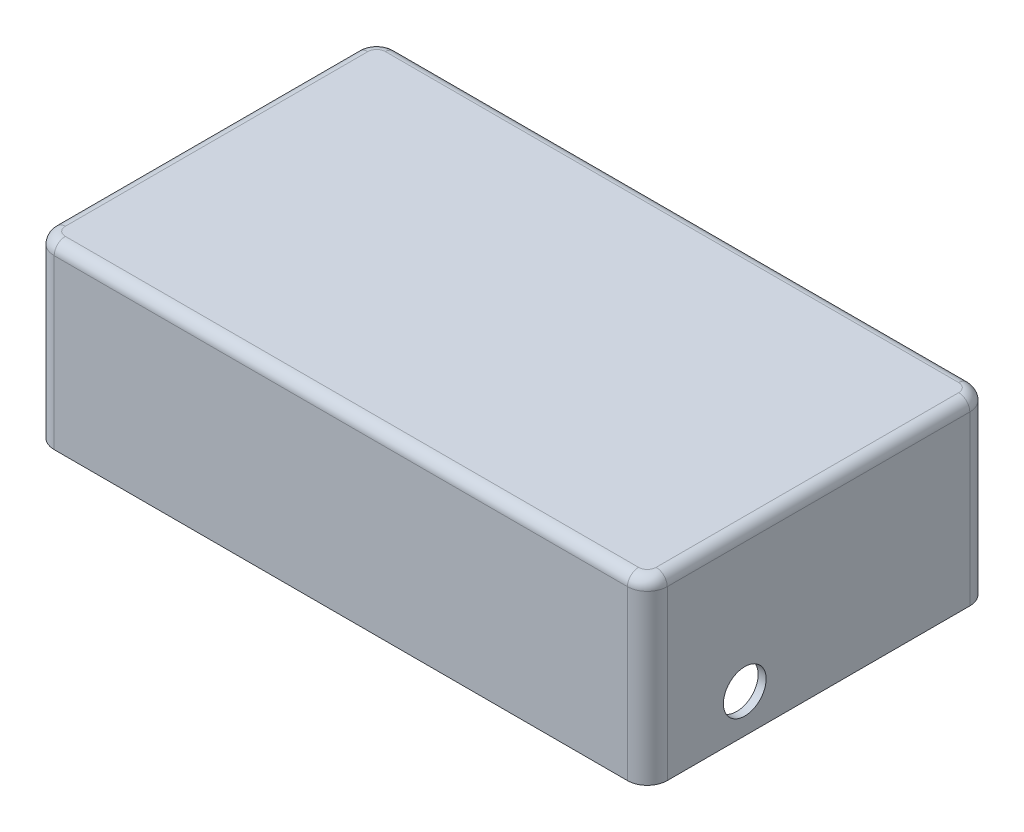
ISO-10303-21;
HEADER;
FILE_DESCRIPTION(('STEP AP214'),'2;1');
FILE_NAME('part.step','',(''),(''),'','','');
FILE_SCHEMA(('AUTOMOTIVE_DESIGN { 1 0 10303 214 1 1 1 1 }'));
ENDSEC;
DATA;
#1=APPLICATION_CONTEXT('core data for automotive mechanical design processes');
#2=APPLICATION_PROTOCOL_DEFINITION('international standard','automotive_design',2000,#1);
#3=PRODUCT_CONTEXT('',#1,'mechanical');
#4=PRODUCT('Part','Part','',(#3));
#5=PRODUCT_RELATED_PRODUCT_CATEGORY('part','',(#4));
#6=PRODUCT_DEFINITION_FORMATION('','',#4);
#7=PRODUCT_DEFINITION_CONTEXT('part definition',#1,'design');
#8=PRODUCT_DEFINITION('design','',#6,#7);
#9=PRODUCT_DEFINITION_SHAPE('','',#8);
#10=(LENGTH_UNIT() NAMED_UNIT(*) SI_UNIT(.MILLI.,.METRE.));
#11=(NAMED_UNIT(*) PLANE_ANGLE_UNIT() SI_UNIT($,.RADIAN.));
#12=(NAMED_UNIT(*) SI_UNIT($,.STERADIAN.) SOLID_ANGLE_UNIT());
#13=UNCERTAINTY_MEASURE_WITH_UNIT(LENGTH_MEASURE(1.E-05),#10,'distance_accuracy_value','');
#14=(GEOMETRIC_REPRESENTATION_CONTEXT(3) GLOBAL_UNCERTAINTY_ASSIGNED_CONTEXT((#13)) GLOBAL_UNIT_ASSIGNED_CONTEXT((#10,
#11,#12)) REPRESENTATION_CONTEXT('',''));
#15=CARTESIAN_POINT('',(0.,0.,0.));
#16=DIRECTION('',(0.,0.,1.));
#17=DIRECTION('',(1.,0.,0.));
#18=AXIS2_PLACEMENT_3D('',#15,#16,#17);
#19=CARTESIAN_POINT('',(0.,57.15,0.));
#20=DIRECTION('',(0.,1.,0.));
#21=DIRECTION('',(0.,0.,1.));
#22=AXIS2_PLACEMENT_3D('',#19,#20,#21);
#23=PLANE('',#22);
#24=CARTESIAN_POINT('',(91.44,57.15,48.26));
#25=DIRECTION('',(0.,1.,0.));
#26=DIRECTION('',(0.,0.,1.));
#27=AXIS2_PLACEMENT_3D('',#24,#25,#26);
#28=CIRCLE('',#27,2.794);
#29=CARTESIAN_POINT('',(94.234,57.15,48.26));
#30=VERTEX_POINT('',#29);
#31=CARTESIAN_POINT('',(91.44,57.15,51.054));
#32=VERTEX_POINT('',#31);
#33=EDGE_CURVE('E336',#30,#32,#28,.F.);
#34=ORIENTED_EDGE('',*,*,#33,.F.);
#35=DIRECTION('',(0.,0.,-1.));
#36=VECTOR('',#35,1.);
#37=CARTESIAN_POINT('',(94.234,57.15,-54.61));
#38=LINE('',#37,#36);
#39=CARTESIAN_POINT('',(94.234,57.15,-48.26));
#40=VERTEX_POINT('',#39);
#41=EDGE_CURVE('E299',#30,#40,#38,.T.);
#42=ORIENTED_EDGE('',*,*,#41,.T.);
#43=CARTESIAN_POINT('',(91.44,57.15,-48.26));
#44=DIRECTION('',(0.,1.,0.));
#45=DIRECTION('',(0.,0.,1.));
#46=AXIS2_PLACEMENT_3D('',#43,#44,#45);
#47=CIRCLE('',#46,2.794);
#48=CARTESIAN_POINT('',(91.44,57.15,-51.054));
#49=VERTEX_POINT('',#48);
#50=EDGE_CURVE('E334',#49,#40,#47,.F.);
#51=ORIENTED_EDGE('',*,*,#50,.F.);
#52=DIRECTION('',(-1.,0.,0.));
#53=VECTOR('',#52,1.);
#54=CARTESIAN_POINT('',(-97.79,57.15,-51.054));
#55=LINE('',#54,#53);
#56=CARTESIAN_POINT('',(-91.44,57.15,-51.054));
#57=VERTEX_POINT('',#56);
#58=EDGE_CURVE('E308',#49,#57,#55,.T.);
#59=ORIENTED_EDGE('',*,*,#58,.T.);
#60=CARTESIAN_POINT('',(-91.44,57.15,-48.26));
#61=DIRECTION('',(0.,1.,0.));
#62=DIRECTION('',(0.,0.,1.));
#63=AXIS2_PLACEMENT_3D('',#60,#61,#62);
#64=CIRCLE('',#63,2.794);
#65=CARTESIAN_POINT('',(-94.234,57.15,-48.26));
#66=VERTEX_POINT('',#65);
#67=EDGE_CURVE('E331',#66,#57,#64,.F.);
#68=ORIENTED_EDGE('',*,*,#67,.F.);
#69=DIRECTION('',(0.,0.,1.));
#70=VECTOR('',#69,1.);
#71=CARTESIAN_POINT('',(-94.234,57.15,54.61));
#72=LINE('',#71,#70);
#73=CARTESIAN_POINT('',(-94.234,57.15,48.26));
#74=VERTEX_POINT('',#73);
#75=EDGE_CURVE('E305',#66,#74,#72,.T.);
#76=ORIENTED_EDGE('',*,*,#75,.T.);
#77=CARTESIAN_POINT('',(-91.44,57.15,48.26));
#78=DIRECTION('',(0.,1.,0.));
#79=DIRECTION('',(0.,0.,1.));
#80=AXIS2_PLACEMENT_3D('',#77,#78,#79);
#81=CIRCLE('',#80,2.794);
#82=CARTESIAN_POINT('',(-91.44,57.15,51.054));
#83=VERTEX_POINT('',#82);
#84=EDGE_CURVE('E328',#83,#74,#81,.F.);
#85=ORIENTED_EDGE('',*,*,#84,.F.);
#86=DIRECTION('',(1.,0.,0.));
#87=VECTOR('',#86,1.);
#88=CARTESIAN_POINT('',(97.79,57.15,51.054));
#89=LINE('',#88,#87);
#90=EDGE_CURVE('E302',#83,#32,#89,.T.);
#91=ORIENTED_EDGE('',*,*,#90,.T.);
#92=EDGE_LOOP('',(#34,#42,#51,#59,#68,#76,#85,#91));
#93=FACE_BOUND('',#92,.T.);
#94=ADVANCED_FACE('F35',(#93),#23,.T.);
#95=CARTESIAN_POINT('',(-97.79,57.15,-54.61));
#96=DIRECTION('',(1.,0.,0.));
#97=DIRECTION('',(0.,0.,-1.));
#98=AXIS2_PLACEMENT_3D('',#95,#96,#97);
#99=PLANE('',#98);
#100=DIRECTION('',(0.,0.,1.));
#101=VECTOR('',#100,1.);
#102=CARTESIAN_POINT('',(-97.79,0.,-54.61));
#103=LINE('',#102,#101);
#104=CARTESIAN_POINT('',(-97.79,0.,-48.26));
#105=VERTEX_POINT('',#104);
#106=CARTESIAN_POINT('',(-97.79,0.,48.26));
#107=VERTEX_POINT('',#106);
#108=EDGE_CURVE('E287',#105,#107,#103,.T.);
#109=ORIENTED_EDGE('',*,*,#108,.T.);
#110=DIRECTION('',(0.,-1.,0.));
#111=VECTOR('',#110,1.);
#112=CARTESIAN_POINT('',(-97.79,57.15,48.26));
#113=LINE('',#112,#111);
#114=CARTESIAN_POINT('',(-97.79,53.594,48.26));
#115=VERTEX_POINT('',#114);
#116=EDGE_CURVE('E364',#107,#115,#113,.F.);
#117=ORIENTED_EDGE('',*,*,#116,.T.);
#118=DIRECTION('',(0.,0.,1.));
#119=VECTOR('',#118,1.);
#120=CARTESIAN_POINT('',(-97.79,53.594,-54.61));
#121=LINE('',#120,#119);
#122=CARTESIAN_POINT('',(-97.79,53.594,-48.26));
#123=VERTEX_POINT('',#122);
#124=EDGE_CURVE('E314',#115,#123,#121,.F.);
#125=ORIENTED_EDGE('',*,*,#124,.T.);
#126=DIRECTION('',(0.,-1.,0.));
#127=VECTOR('',#126,1.);
#128=CARTESIAN_POINT('',(-97.79,57.15,-48.26));
#129=LINE('',#128,#127);
#130=EDGE_CURVE('E362',#123,#105,#129,.T.);
#131=ORIENTED_EDGE('',*,*,#130,.T.);
#132=EDGE_LOOP('',(#109,#117,#125,#131));
#133=FACE_BOUND('',#132,.T.);
#134=ADVANCED_FACE('F488',(#133),#99,.F.);
#135=CARTESIAN_POINT('',(-97.79,57.15,54.61));
#136=DIRECTION('',(0.,0.,-1.));
#137=DIRECTION('',(-1.,0.,0.));
#138=AXIS2_PLACEMENT_3D('',#135,#136,#137);
#139=PLANE('',#138);
#140=DIRECTION('',(1.,0.,0.));
#141=VECTOR('',#140,1.);
#142=CARTESIAN_POINT('',(-97.79,53.594,54.61));
#143=LINE('',#142,#141);
#144=CARTESIAN_POINT('',(91.44,53.594,54.61));
#145=VERTEX_POINT('',#144);
#146=CARTESIAN_POINT('',(-91.44,53.594,54.61));
#147=VERTEX_POINT('',#146);
#148=EDGE_CURVE('E317',#145,#147,#143,.F.);
#149=ORIENTED_EDGE('',*,*,#148,.T.);
#150=DIRECTION('',(0.,-1.,0.));
#151=VECTOR('',#150,1.);
#152=CARTESIAN_POINT('',(-91.44,57.15,54.61));
#153=LINE('',#152,#151);
#154=CARTESIAN_POINT('',(-91.44,0.,54.61));
#155=VERTEX_POINT('',#154);
#156=EDGE_CURVE('E353',#147,#155,#153,.T.);
#157=ORIENTED_EDGE('',*,*,#156,.T.);
#158=DIRECTION('',(1.,0.,0.));
#159=VECTOR('',#158,1.);
#160=CARTESIAN_POINT('',(-97.79,0.,54.61));
#161=LINE('',#160,#159);
#162=CARTESIAN_POINT('',(91.44,0.,54.61));
#163=VERTEX_POINT('',#162);
#164=EDGE_CURVE('E290',#155,#163,#161,.T.);
#165=ORIENTED_EDGE('',*,*,#164,.T.);
#166=DIRECTION('',(0.,-1.,0.));
#167=VECTOR('',#166,1.);
#168=CARTESIAN_POINT('',(91.44,57.15,54.61));
#169=LINE('',#168,#167);
#170=EDGE_CURVE('E351',#163,#145,#169,.F.);
#171=ORIENTED_EDGE('',*,*,#170,.T.);
#172=EDGE_LOOP('',(#149,#157,#165,#171));
#173=FACE_BOUND('',#172,.T.);
#174=ADVANCED_FACE('F446',(#173),#139,.F.);
#175=CARTESIAN_POINT('',(97.79,57.15,-54.61));
#176=DIRECTION('',(-1.,0.,0.));
#177=DIRECTION('',(0.,0.,1.));
#178=AXIS2_PLACEMENT_3D('',#175,#176,#177);
#179=PLANE('',#178);
#180=CARTESIAN_POINT('',(97.79,12.3054100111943,23.5333339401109));
#181=DIRECTION('',(1.,0.,0.));
#182=DIRECTION('',(0.,0.,-1.));
#183=AXIS2_PLACEMENT_3D('',#180,#181,#182);
#184=CIRCLE('',#183,6.82354044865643);
#185=CARTESIAN_POINT('',(97.79,12.3054100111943,16.7097934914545));
#186=VERTEX_POINT('',#185);
#187=EDGE_CURVE('E427',#186,#186,#184,.T.);
#188=ORIENTED_EDGE('',*,*,#187,.F.);
#189=EDGE_LOOP('',(#188));
#190=FACE_BOUND('',#189,.T.);
#191=DIRECTION('',(0.,0.,-1.));
#192=VECTOR('',#191,1.);
#193=CARTESIAN_POINT('',(97.79,0.,-54.61));
#194=LINE('',#193,#192);
#195=CARTESIAN_POINT('',(97.79,0.,48.26));
#196=VERTEX_POINT('',#195);
#197=CARTESIAN_POINT('',(97.79,0.,-48.26));
#198=VERTEX_POINT('',#197);
#199=EDGE_CURVE('E294',#196,#198,#194,.T.);
#200=ORIENTED_EDGE('',*,*,#199,.T.);
#201=DIRECTION('',(0.,-1.,0.));
#202=VECTOR('',#201,1.);
#203=CARTESIAN_POINT('',(97.79,57.15,-48.26));
#204=LINE('',#203,#202);
#205=CARTESIAN_POINT('',(97.79,53.594,-48.26));
#206=VERTEX_POINT('',#205);
#207=EDGE_CURVE('E11',#198,#206,#204,.F.);
#208=ORIENTED_EDGE('',*,*,#207,.T.);
#209=DIRECTION('',(0.,0.,-1.));
#210=VECTOR('',#209,1.);
#211=CARTESIAN_POINT('',(97.79,53.594,54.61));
#212=LINE('',#211,#210);
#213=CARTESIAN_POINT('',(97.79,53.594,48.26));
#214=VERTEX_POINT('',#213);
#215=EDGE_CURVE('E320',#206,#214,#212,.F.);
#216=ORIENTED_EDGE('',*,*,#215,.T.);
#217=DIRECTION('',(0.,-1.,0.));
#218=VECTOR('',#217,1.);
#219=CARTESIAN_POINT('',(97.79,57.15,48.26));
#220=LINE('',#219,#218);
#221=EDGE_CURVE('E44',#214,#196,#220,.T.);
#222=ORIENTED_EDGE('',*,*,#221,.T.);
#223=EDGE_LOOP('',(#200,#208,#216,#222));
#224=FACE_BOUND('',#223,.T.);
#225=ADVANCED_FACE('F442',(#190,#224),#179,.F.);
#226=CARTESIAN_POINT('',(-97.79,57.15,-54.61));
#227=DIRECTION('',(0.,0.,1.));
#228=DIRECTION('',(1.,0.,0.));
#229=AXIS2_PLACEMENT_3D('',#226,#227,#228);
#230=PLANE('',#229);
#231=DIRECTION('',(-1.,0.,0.));
#232=VECTOR('',#231,1.);
#233=CARTESIAN_POINT('',(-97.79,0.,-54.61));
#234=LINE('',#233,#232);
#235=CARTESIAN_POINT('',(91.44,0.,-54.61));
#236=VERTEX_POINT('',#235);
#237=CARTESIAN_POINT('',(-91.44,0.,-54.61));
#238=VERTEX_POINT('',#237);
#239=EDGE_CURVE('E296',#236,#238,#234,.T.);
#240=ORIENTED_EDGE('',*,*,#239,.T.);
#241=DIRECTION('',(0.,-1.,0.));
#242=VECTOR('',#241,1.);
#243=CARTESIAN_POINT('',(-91.44,57.15,-54.61));
#244=LINE('',#243,#242);
#245=CARTESIAN_POINT('',(-91.44,53.594,-54.61));
#246=VERTEX_POINT('',#245);
#247=EDGE_CURVE('E368',#238,#246,#244,.F.);
#248=ORIENTED_EDGE('',*,*,#247,.T.);
#249=DIRECTION('',(-1.,0.,0.));
#250=VECTOR('',#249,1.);
#251=CARTESIAN_POINT('',(97.79,53.594,-54.61));
#252=LINE('',#251,#250);
#253=CARTESIAN_POINT('',(91.44,53.594,-54.61));
#254=VERTEX_POINT('',#253);
#255=EDGE_CURVE('E311',#246,#254,#252,.F.);
#256=ORIENTED_EDGE('',*,*,#255,.T.);
#257=DIRECTION('',(0.,-1.,0.));
#258=VECTOR('',#257,1.);
#259=CARTESIAN_POINT('',(91.44,57.15,-54.61));
#260=LINE('',#259,#258);
#261=EDGE_CURVE('E366',#254,#236,#260,.T.);
#262=ORIENTED_EDGE('',*,*,#261,.T.);
#263=EDGE_LOOP('',(#240,#248,#256,#262));
#264=FACE_BOUND('',#263,.T.);
#265=ADVANCED_FACE('F445',(#264),#230,.F.);
#266=CARTESIAN_POINT('',(0.,0.,0.));
#267=DIRECTION('',(0.,1.,0.));
#268=DIRECTION('',(0.,0.,1.));
#269=AXIS2_PLACEMENT_3D('',#266,#267,#268);
#270=PLANE('',#269);
#271=CARTESIAN_POINT('',(-91.44,0.,48.26));
#272=DIRECTION('',(0.,1.,0.));
#273=DIRECTION('',(0.,0.,1.));
#274=AXIS2_PLACEMENT_3D('',#271,#272,#273);
#275=CIRCLE('',#274,3.81);
#276=CARTESIAN_POINT('',(-91.44,0.,52.07));
#277=VERTEX_POINT('',#276);
#278=CARTESIAN_POINT('',(-95.25,0.,48.26));
#279=VERTEX_POINT('',#278);
#280=EDGE_CURVE('E255',#277,#279,#275,.F.);
#281=ORIENTED_EDGE('',*,*,#280,.F.);
#282=DIRECTION('',(1.,0.,0.));
#283=VECTOR('',#282,1.);
#284=CARTESIAN_POINT('',(-97.79,0.,52.07));
#285=LINE('',#284,#283);
#286=CARTESIAN_POINT('',(91.44,0.,52.07));
#287=VERTEX_POINT('',#286);
#288=EDGE_CURVE('E270',#277,#287,#285,.T.);
#289=ORIENTED_EDGE('',*,*,#288,.T.);
#290=CARTESIAN_POINT('',(91.44,0.,48.26));
#291=DIRECTION('',(0.,1.,0.));
#292=DIRECTION('',(0.,0.,1.));
#293=AXIS2_PLACEMENT_3D('',#290,#291,#292);
#294=CIRCLE('',#293,3.81);
#295=CARTESIAN_POINT('',(95.25,0.,48.26));
#296=VERTEX_POINT('',#295);
#297=EDGE_CURVE('E283',#296,#287,#294,.F.);
#298=ORIENTED_EDGE('',*,*,#297,.F.);
#299=DIRECTION('',(0.,0.,-1.));
#300=VECTOR('',#299,1.);
#301=CARTESIAN_POINT('',(95.25,0.,-54.61));
#302=LINE('',#301,#300);
#303=CARTESIAN_POINT('',(95.25,0.,-48.26));
#304=VERTEX_POINT('',#303);
#305=EDGE_CURVE('E52',#296,#304,#302,.T.);
#306=ORIENTED_EDGE('',*,*,#305,.T.);
#307=CARTESIAN_POINT('',(91.44,0.,-48.26));
#308=DIRECTION('',(0.,1.,0.));
#309=DIRECTION('',(0.,0.,1.));
#310=AXIS2_PLACEMENT_3D('',#307,#308,#309);
#311=CIRCLE('',#310,3.81);
#312=CARTESIAN_POINT('',(91.44,0.,-52.07));
#313=VERTEX_POINT('',#312);
#314=EDGE_CURVE('E279',#313,#304,#311,.F.);
#315=ORIENTED_EDGE('',*,*,#314,.F.);
#316=DIRECTION('',(-1.,0.,0.));
#317=VECTOR('',#316,1.);
#318=CARTESIAN_POINT('',(-97.79,0.,-52.07));
#319=LINE('',#318,#317);
#320=CARTESIAN_POINT('',(-91.44,0.,-52.07));
#321=VERTEX_POINT('',#320);
#322=EDGE_CURVE('E222',#313,#321,#319,.T.);
#323=ORIENTED_EDGE('',*,*,#322,.T.);
#324=CARTESIAN_POINT('',(-91.44,0.,-48.26));
#325=DIRECTION('',(0.,1.,0.));
#326=DIRECTION('',(0.,0.,1.));
#327=AXIS2_PLACEMENT_3D('',#324,#325,#326);
#328=CIRCLE('',#327,3.81);
#329=CARTESIAN_POINT('',(-95.25,0.,-48.26));
#330=VERTEX_POINT('',#329);
#331=EDGE_CURVE('E275',#330,#321,#328,.F.);
#332=ORIENTED_EDGE('',*,*,#331,.F.);
#333=DIRECTION('',(0.,0.,1.));
#334=VECTOR('',#333,1.);
#335=CARTESIAN_POINT('',(-95.25,0.,-54.61));
#336=LINE('',#335,#334);
#337=EDGE_CURVE('E273',#330,#279,#336,.T.);
#338=ORIENTED_EDGE('',*,*,#337,.T.);
#339=EDGE_LOOP('',(#281,#289,#298,#306,#315,#323,#332,#338));
#340=FACE_BOUND('',#339,.T.);
#341=ORIENTED_EDGE('',*,*,#164,.F.);
#342=CARTESIAN_POINT('',(-91.44,0.,48.26));
#343=DIRECTION('',(0.,1.,0.));
#344=DIRECTION('',(0.,0.,1.));
#345=AXIS2_PLACEMENT_3D('',#342,#343,#344);
#346=CIRCLE('',#345,6.35);
#347=EDGE_CURVE('E360',#155,#107,#346,.F.);
#348=ORIENTED_EDGE('',*,*,#347,.T.);
#349=ORIENTED_EDGE('',*,*,#108,.F.);
#350=CARTESIAN_POINT('',(-91.44,0.,-48.26));
#351=DIRECTION('',(0.,1.,0.));
#352=DIRECTION('',(0.,0.,1.));
#353=AXIS2_PLACEMENT_3D('',#350,#351,#352);
#354=CIRCLE('',#353,6.35);
#355=EDGE_CURVE('E358',#105,#238,#354,.F.);
#356=ORIENTED_EDGE('',*,*,#355,.T.);
#357=ORIENTED_EDGE('',*,*,#239,.F.);
#358=CARTESIAN_POINT('',(91.44,0.,-48.26));
#359=DIRECTION('',(0.,1.,0.));
#360=DIRECTION('',(0.,0.,1.));
#361=AXIS2_PLACEMENT_3D('',#358,#359,#360);
#362=CIRCLE('',#361,6.35);
#363=EDGE_CURVE('E60',#236,#198,#362,.F.);
#364=ORIENTED_EDGE('',*,*,#363,.T.);
#365=ORIENTED_EDGE('',*,*,#199,.F.);
#366=CARTESIAN_POINT('',(91.44,0.,48.26));
#367=DIRECTION('',(0.,1.,0.));
#368=DIRECTION('',(0.,0.,1.));
#369=AXIS2_PLACEMENT_3D('',#366,#367,#368);
#370=CIRCLE('',#369,6.35);
#371=EDGE_CURVE('E355',#196,#163,#370,.F.);
#372=ORIENTED_EDGE('',*,*,#371,.T.);
#373=EDGE_LOOP('',(#341,#348,#349,#356,#357,#364,#365,#372));
#374=FACE_BOUND('',#373,.T.);
#375=ADVANCED_FACE('F481',(#340,#374),#270,.F.);
#376=CARTESIAN_POINT('',(0.,53.594,51.054));
#377=DIRECTION('',(-1.,0.,0.));
#378=DIRECTION('',(0.,0.,1.));
#379=AXIS2_PLACEMENT_3D('',#376,#377,#378);
#380=CYLINDRICAL_SURFACE('',#379,3.556);
#381=ORIENTED_EDGE('',*,*,#148,.F.);
#382=CARTESIAN_POINT('',(91.44,53.594,51.054));
#383=DIRECTION('',(-1.,0.,0.));
#384=DIRECTION('',(0.,0.,1.));
#385=AXIS2_PLACEMENT_3D('',#382,#383,#384);
#386=CIRCLE('',#385,3.556);
#387=EDGE_CURVE('E325',#145,#32,#386,.T.);
#388=ORIENTED_EDGE('',*,*,#387,.T.);
#389=ORIENTED_EDGE('',*,*,#90,.F.);
#390=CARTESIAN_POINT('',(-91.44,53.594,51.054));
#391=DIRECTION('',(1.,0.,0.));
#392=DIRECTION('',(0.,0.,-1.));
#393=AXIS2_PLACEMENT_3D('',#390,#391,#392);
#394=CIRCLE('',#393,3.556);
#395=EDGE_CURVE('E323',#83,#147,#394,.T.);
#396=ORIENTED_EDGE('',*,*,#395,.T.);
#397=EDGE_LOOP('',(#381,#388,#389,#396));
#398=FACE_BOUND('',#397,.T.);
#399=ADVANCED_FACE('F473',(#398),#380,.T.);
#400=CARTESIAN_POINT('',(94.234,53.594,0.));
#401=DIRECTION('',(0.,0.,1.));
#402=DIRECTION('',(1.,0.,0.));
#403=AXIS2_PLACEMENT_3D('',#400,#401,#402);
#404=CYLINDRICAL_SURFACE('',#403,3.556);
#405=ORIENTED_EDGE('',*,*,#215,.F.);
#406=CARTESIAN_POINT('',(94.234,53.594,-48.26));
#407=DIRECTION('',(0.,0.,1.));
#408=DIRECTION('',(1.,0.,0.));
#409=AXIS2_PLACEMENT_3D('',#406,#407,#408);
#410=CIRCLE('',#409,3.556);
#411=EDGE_CURVE('E340',#206,#40,#410,.T.);
#412=ORIENTED_EDGE('',*,*,#411,.T.);
#413=ORIENTED_EDGE('',*,*,#41,.F.);
#414=CARTESIAN_POINT('',(94.234,53.594,48.26));
#415=DIRECTION('',(0.,0.,-1.));
#416=DIRECTION('',(-1.,0.,0.));
#417=AXIS2_PLACEMENT_3D('',#414,#415,#416);
#418=CIRCLE('',#417,3.556);
#419=EDGE_CURVE('E338',#30,#214,#418,.T.);
#420=ORIENTED_EDGE('',*,*,#419,.T.);
#421=EDGE_LOOP('',(#405,#412,#413,#420));
#422=FACE_BOUND('',#421,.T.);
#423=ADVANCED_FACE('F462',(#422),#404,.T.);
#424=CARTESIAN_POINT('',(-94.234,53.594,0.));
#425=DIRECTION('',(0.,0.,-1.));
#426=DIRECTION('',(-1.,0.,0.));
#427=AXIS2_PLACEMENT_3D('',#424,#425,#426);
#428=CYLINDRICAL_SURFACE('',#427,3.556);
#429=ORIENTED_EDGE('',*,*,#124,.F.);
#430=CARTESIAN_POINT('',(-94.234,53.594,48.26));
#431=DIRECTION('',(0.,0.,-1.));
#432=DIRECTION('',(-1.,0.,0.));
#433=AXIS2_PLACEMENT_3D('',#430,#431,#432);
#434=CIRCLE('',#433,3.556);
#435=EDGE_CURVE('E349',#115,#74,#434,.T.);
#436=ORIENTED_EDGE('',*,*,#435,.T.);
#437=ORIENTED_EDGE('',*,*,#75,.F.);
#438=CARTESIAN_POINT('',(-94.234,53.594,-48.26));
#439=DIRECTION('',(0.,0.,1.));
#440=DIRECTION('',(1.,0.,0.));
#441=AXIS2_PLACEMENT_3D('',#438,#439,#440);
#442=CIRCLE('',#441,3.556);
#443=EDGE_CURVE('E347',#66,#123,#442,.T.);
#444=ORIENTED_EDGE('',*,*,#443,.T.);
#445=EDGE_LOOP('',(#429,#436,#437,#444));
#446=FACE_BOUND('',#445,.T.);
#447=ADVANCED_FACE('F502',(#446),#428,.T.);
#448=CARTESIAN_POINT('',(0.,53.594,-51.054));
#449=DIRECTION('',(1.,0.,0.));
#450=DIRECTION('',(0.,0.,-1.));
#451=AXIS2_PLACEMENT_3D('',#448,#449,#450);
#452=CYLINDRICAL_SURFACE('',#451,3.556);
#453=ORIENTED_EDGE('',*,*,#255,.F.);
#454=CARTESIAN_POINT('',(-91.44,53.594,-51.054));
#455=DIRECTION('',(1.,0.,0.));
#456=DIRECTION('',(0.,0.,-1.));
#457=AXIS2_PLACEMENT_3D('',#454,#455,#456);
#458=CIRCLE('',#457,3.556);
#459=EDGE_CURVE('E345',#246,#57,#458,.T.);
#460=ORIENTED_EDGE('',*,*,#459,.T.);
#461=ORIENTED_EDGE('',*,*,#58,.F.);
#462=CARTESIAN_POINT('',(91.44,53.594,-51.054));
#463=DIRECTION('',(-1.,0.,0.));
#464=DIRECTION('',(0.,0.,1.));
#465=AXIS2_PLACEMENT_3D('',#462,#463,#464);
#466=CIRCLE('',#465,3.556);
#467=EDGE_CURVE('E343',#49,#254,#466,.T.);
#468=ORIENTED_EDGE('',*,*,#467,.T.);
#469=EDGE_LOOP('',(#453,#460,#461,#468));
#470=FACE_BOUND('',#469,.T.);
#471=ADVANCED_FACE('F497',(#470),#452,.T.);
#472=CARTESIAN_POINT('',(91.44,57.15,48.26));
#473=DIRECTION('',(0.,-1.,0.));
#474=DIRECTION('',(0.,0.,-1.));
#475=AXIS2_PLACEMENT_3D('',#472,#473,#474);
#476=CYLINDRICAL_SURFACE('',#475,6.35);
#477=ORIENTED_EDGE('',*,*,#371,.F.);
#478=ORIENTED_EDGE('',*,*,#221,.F.);
#479=CARTESIAN_POINT('',(91.44,53.594,48.26));
#480=DIRECTION('',(0.,1.,0.));
#481=DIRECTION('',(0.,0.,1.));
#482=AXIS2_PLACEMENT_3D('',#479,#480,#481);
#483=CIRCLE('',#482,6.35);
#484=EDGE_CURVE('E291',#145,#214,#483,.T.);
#485=ORIENTED_EDGE('',*,*,#484,.F.);
#486=ORIENTED_EDGE('',*,*,#170,.F.);
#487=EDGE_LOOP('',(#477,#478,#485,#486));
#488=FACE_BOUND('',#487,.T.);
#489=ADVANCED_FACE('F479',(#488),#476,.T.);
#490=CARTESIAN_POINT('',(91.44,53.594,48.26));
#491=DIRECTION('',(0.,1.,0.));
#492=DIRECTION('',(0.,0.,1.));
#493=AXIS2_PLACEMENT_3D('',#490,#491,#492);
#494=DEGENERATE_TOROIDAL_SURFACE('',#493,2.794,3.556,.T.);
#495=ORIENTED_EDGE('',*,*,#387,.F.);
#496=ORIENTED_EDGE('',*,*,#484,.T.);
#497=ORIENTED_EDGE('',*,*,#419,.F.);
#498=ORIENTED_EDGE('',*,*,#33,.T.);
#499=EDGE_LOOP('',(#495,#496,#497,#498));
#500=FACE_BOUND('',#499,.T.);
#501=ADVANCED_FACE('F470',(#500),#494,.T.);
#502=CARTESIAN_POINT('',(91.44,57.15,-48.26));
#503=DIRECTION('',(0.,-1.,0.));
#504=DIRECTION('',(0.,0.,-1.));
#505=AXIS2_PLACEMENT_3D('',#502,#503,#504);
#506=CYLINDRICAL_SURFACE('',#505,6.35);
#507=ORIENTED_EDGE('',*,*,#363,.F.);
#508=ORIENTED_EDGE('',*,*,#261,.F.);
#509=CARTESIAN_POINT('',(91.44,53.594,-48.26));
#510=DIRECTION('',(0.,1.,0.));
#511=DIRECTION('',(0.,0.,1.));
#512=AXIS2_PLACEMENT_3D('',#509,#510,#511);
#513=CIRCLE('',#512,6.35);
#514=EDGE_CURVE('E373',#206,#254,#513,.T.);
#515=ORIENTED_EDGE('',*,*,#514,.F.);
#516=ORIENTED_EDGE('',*,*,#207,.F.);
#517=EDGE_LOOP('',(#507,#508,#515,#516));
#518=FACE_BOUND('',#517,.T.);
#519=ADVANCED_FACE('F454',(#518),#506,.T.);
#520=CARTESIAN_POINT('',(91.44,53.594,-48.26));
#521=DIRECTION('',(0.,1.,0.));
#522=DIRECTION('',(0.,0.,1.));
#523=AXIS2_PLACEMENT_3D('',#520,#521,#522);
#524=DEGENERATE_TOROIDAL_SURFACE('',#523,2.794,3.556,.T.);
#525=ORIENTED_EDGE('',*,*,#411,.F.);
#526=ORIENTED_EDGE('',*,*,#514,.T.);
#527=ORIENTED_EDGE('',*,*,#467,.F.);
#528=ORIENTED_EDGE('',*,*,#50,.T.);
#529=EDGE_LOOP('',(#525,#526,#527,#528));
#530=FACE_BOUND('',#529,.T.);
#531=ADVANCED_FACE('F459',(#530),#524,.T.);
#532=CARTESIAN_POINT('',(-91.44,57.15,-48.26));
#533=DIRECTION('',(0.,-1.,0.));
#534=DIRECTION('',(0.,0.,-1.));
#535=AXIS2_PLACEMENT_3D('',#532,#533,#534);
#536=CYLINDRICAL_SURFACE('',#535,6.35);
#537=ORIENTED_EDGE('',*,*,#355,.F.);
#538=ORIENTED_EDGE('',*,*,#130,.F.);
#539=CARTESIAN_POINT('',(-91.44,53.594,-48.26));
#540=DIRECTION('',(0.,1.,0.));
#541=DIRECTION('',(0.,0.,1.));
#542=AXIS2_PLACEMENT_3D('',#539,#540,#541);
#543=CIRCLE('',#542,6.35);
#544=EDGE_CURVE('E375',#246,#123,#543,.T.);
#545=ORIENTED_EDGE('',*,*,#544,.F.);
#546=ORIENTED_EDGE('',*,*,#247,.F.);
#547=EDGE_LOOP('',(#537,#538,#545,#546));
#548=FACE_BOUND('',#547,.T.);
#549=ADVANCED_FACE('F492',(#548),#536,.T.);
#550=CARTESIAN_POINT('',(-91.44,53.594,-48.26));
#551=DIRECTION('',(0.,1.,0.));
#552=DIRECTION('',(0.,0.,1.));
#553=AXIS2_PLACEMENT_3D('',#550,#551,#552);
#554=DEGENERATE_TOROIDAL_SURFACE('',#553,2.794,3.556,.T.);
#555=ORIENTED_EDGE('',*,*,#443,.F.);
#556=ORIENTED_EDGE('',*,*,#67,.T.);
#557=ORIENTED_EDGE('',*,*,#459,.F.);
#558=ORIENTED_EDGE('',*,*,#544,.T.);
#559=EDGE_LOOP('',(#555,#556,#557,#558));
#560=FACE_BOUND('',#559,.T.);
#561=ADVANCED_FACE('F500',(#560),#554,.T.);
#562=CARTESIAN_POINT('',(-91.44,57.15,48.26));
#563=DIRECTION('',(0.,-1.,0.));
#564=DIRECTION('',(0.,0.,-1.));
#565=AXIS2_PLACEMENT_3D('',#562,#563,#564);
#566=CYLINDRICAL_SURFACE('',#565,6.35);
#567=ORIENTED_EDGE('',*,*,#347,.F.);
#568=ORIENTED_EDGE('',*,*,#156,.F.);
#569=CARTESIAN_POINT('',(-91.44,53.594,48.26));
#570=DIRECTION('',(0.,1.,0.));
#571=DIRECTION('',(0.,0.,1.));
#572=AXIS2_PLACEMENT_3D('',#569,#570,#571);
#573=CIRCLE('',#572,6.35);
#574=EDGE_CURVE('E39',#115,#147,#573,.T.);
#575=ORIENTED_EDGE('',*,*,#574,.F.);
#576=ORIENTED_EDGE('',*,*,#116,.F.);
#577=EDGE_LOOP('',(#567,#568,#575,#576));
#578=FACE_BOUND('',#577,.T.);
#579=ADVANCED_FACE('F37',(#578),#566,.T.);
#580=CARTESIAN_POINT('',(-91.44,53.594,48.26));
#581=DIRECTION('',(0.,1.,0.));
#582=DIRECTION('',(0.,0.,1.));
#583=AXIS2_PLACEMENT_3D('',#580,#581,#582);
#584=DEGENERATE_TOROIDAL_SURFACE('',#583,2.794,3.556,.T.);
#585=ORIENTED_EDGE('',*,*,#395,.F.);
#586=ORIENTED_EDGE('',*,*,#84,.T.);
#587=ORIENTED_EDGE('',*,*,#435,.F.);
#588=ORIENTED_EDGE('',*,*,#574,.T.);
#589=EDGE_LOOP('',(#585,#586,#587,#588));
#590=FACE_BOUND('',#589,.T.);
#591=ADVANCED_FACE('F503',(#590),#584,.T.);
#592=CARTESIAN_POINT('',(0.,54.61,0.));
#593=DIRECTION('',(0.,1.,0.));
#594=DIRECTION('',(0.,0.,1.));
#595=AXIS2_PLACEMENT_3D('',#592,#593,#594);
#596=PLANE('',#595);
#597=CARTESIAN_POINT('',(91.44,54.61,48.26));
#598=DIRECTION('',(0.,1.,0.));
#599=DIRECTION('',(0.,0.,1.));
#600=AXIS2_PLACEMENT_3D('',#597,#598,#599);
#601=CIRCLE('',#600,2.794);
#602=CARTESIAN_POINT('',(94.234,54.61,48.26));
#603=VERTEX_POINT('',#602);
#604=CARTESIAN_POINT('',(91.44,54.61,51.054));
#605=VERTEX_POINT('',#604);
#606=EDGE_CURVE('E200',#603,#605,#601,.F.);
#607=ORIENTED_EDGE('',*,*,#606,.T.);
#608=DIRECTION('',(1.,0.,0.));
#609=VECTOR('',#608,1.);
#610=CARTESIAN_POINT('',(0.,54.61,51.054));
#611=LINE('',#610,#609);
#612=CARTESIAN_POINT('',(-91.44,54.61,51.054));
#613=VERTEX_POINT('',#612);
#614=EDGE_CURVE('E221',#613,#605,#611,.T.);
#615=ORIENTED_EDGE('',*,*,#614,.F.);
#616=CARTESIAN_POINT('',(-91.44,54.61,48.26));
#617=DIRECTION('',(0.,1.,0.));
#618=DIRECTION('',(0.,0.,1.));
#619=AXIS2_PLACEMENT_3D('',#616,#617,#618);
#620=CIRCLE('',#619,2.794);
#621=CARTESIAN_POINT('',(-94.234,54.61,48.26));
#622=VERTEX_POINT('',#621);
#623=EDGE_CURVE('E399',#613,#622,#620,.F.);
#624=ORIENTED_EDGE('',*,*,#623,.T.);
#625=DIRECTION('',(0.,0.,1.));
#626=VECTOR('',#625,1.);
#627=CARTESIAN_POINT('',(-94.234,54.61,0.));
#628=LINE('',#627,#626);
#629=CARTESIAN_POINT('',(-94.234,54.61,-48.26));
#630=VERTEX_POINT('',#629);
#631=EDGE_CURVE('E413',#630,#622,#628,.T.);
#632=ORIENTED_EDGE('',*,*,#631,.F.);
#633=CARTESIAN_POINT('',(-91.44,54.61,-48.26));
#634=DIRECTION('',(0.,1.,0.));
#635=DIRECTION('',(0.,0.,1.));
#636=AXIS2_PLACEMENT_3D('',#633,#634,#635);
#637=CIRCLE('',#636,2.794);
#638=CARTESIAN_POINT('',(-91.44,54.61,-51.054));
#639=VERTEX_POINT('',#638);
#640=EDGE_CURVE('E422',#630,#639,#637,.F.);
#641=ORIENTED_EDGE('',*,*,#640,.T.);
#642=DIRECTION('',(1.,0.,0.));
#643=VECTOR('',#642,1.);
#644=CARTESIAN_POINT('',(0.,54.61,-51.054));
#645=LINE('',#644,#643);
#646=CARTESIAN_POINT('',(91.44,54.61,-51.054));
#647=VERTEX_POINT('',#646);
#648=EDGE_CURVE('E248',#647,#639,#645,.F.);
#649=ORIENTED_EDGE('',*,*,#648,.F.);
#650=CARTESIAN_POINT('',(91.44,54.61,-48.26));
#651=DIRECTION('',(0.,1.,0.));
#652=DIRECTION('',(0.,0.,1.));
#653=AXIS2_PLACEMENT_3D('',#650,#651,#652);
#654=CIRCLE('',#653,2.794);
#655=CARTESIAN_POINT('',(94.234,54.61,-48.26));
#656=VERTEX_POINT('',#655);
#657=EDGE_CURVE('E212',#647,#656,#654,.F.);
#658=ORIENTED_EDGE('',*,*,#657,.T.);
#659=DIRECTION('',(0.,0.,1.));
#660=VECTOR('',#659,1.);
#661=CARTESIAN_POINT('',(94.234,54.61,0.));
#662=LINE('',#661,#660);
#663=EDGE_CURVE('E215',#603,#656,#662,.F.);
#664=ORIENTED_EDGE('',*,*,#663,.F.);
#665=EDGE_LOOP('',(#607,#615,#624,#632,#641,#649,#658,#664));
#666=FACE_BOUND('',#665,.T.);
#667=ADVANCED_FACE('F216',(#666),#596,.F.);
#668=CARTESIAN_POINT('',(-95.25,57.15,-54.61));
#669=DIRECTION('',(1.,0.,0.));
#670=DIRECTION('',(0.,0.,-1.));
#671=AXIS2_PLACEMENT_3D('',#668,#669,#670);
#672=PLANE('',#671);
#673=ORIENTED_EDGE('',*,*,#337,.F.);
#674=DIRECTION('',(0.,1.,0.));
#675=VECTOR('',#674,1.);
#676=CARTESIAN_POINT('',(-95.25,57.15,-48.26));
#677=LINE('',#676,#675);
#678=CARTESIAN_POINT('',(-95.25,53.594,-48.26));
#679=VERTEX_POINT('',#678);
#680=EDGE_CURVE('E253',#679,#330,#677,.F.);
#681=ORIENTED_EDGE('',*,*,#680,.F.);
#682=DIRECTION('',(0.,0.,-1.));
#683=VECTOR('',#682,1.);
#684=CARTESIAN_POINT('',(-95.25,53.594,-54.61));
#685=LINE('',#684,#683);
#686=CARTESIAN_POINT('',(-95.25,53.594,48.26));
#687=VERTEX_POINT('',#686);
#688=EDGE_CURVE('E247',#687,#679,#685,.T.);
#689=ORIENTED_EDGE('',*,*,#688,.F.);
#690=DIRECTION('',(0.,1.,0.));
#691=VECTOR('',#690,1.);
#692=CARTESIAN_POINT('',(-95.25,57.15,48.26));
#693=LINE('',#692,#691);
#694=EDGE_CURVE('E236',#279,#687,#693,.T.);
#695=ORIENTED_EDGE('',*,*,#694,.F.);
#696=EDGE_LOOP('',(#673,#681,#689,#695));
#697=FACE_BOUND('',#696,.T.);
#698=ADVANCED_FACE('F509',(#697),#672,.T.);
#699=CARTESIAN_POINT('',(-97.79,57.15,52.07));
#700=DIRECTION('',(0.,0.,-1.));
#701=DIRECTION('',(-1.,0.,0.));
#702=AXIS2_PLACEMENT_3D('',#699,#700,#701);
#703=PLANE('',#702);
#704=DIRECTION('',(-1.,0.,0.));
#705=VECTOR('',#704,1.);
#706=CARTESIAN_POINT('',(-97.79,53.594,52.07));
#707=LINE('',#706,#705);
#708=CARTESIAN_POINT('',(91.44,53.594,52.07));
#709=VERTEX_POINT('',#708);
#710=CARTESIAN_POINT('',(-91.44,53.594,52.07));
#711=VERTEX_POINT('',#710);
#712=EDGE_CURVE('E262',#709,#711,#707,.T.);
#713=ORIENTED_EDGE('',*,*,#712,.F.);
#714=DIRECTION('',(0.,1.,0.));
#715=VECTOR('',#714,1.);
#716=CARTESIAN_POINT('',(91.44,57.15,52.07));
#717=LINE('',#716,#715);
#718=EDGE_CURVE('E265',#287,#709,#717,.T.);
#719=ORIENTED_EDGE('',*,*,#718,.F.);
#720=ORIENTED_EDGE('',*,*,#288,.F.);
#721=DIRECTION('',(0.,1.,0.));
#722=VECTOR('',#721,1.);
#723=CARTESIAN_POINT('',(-91.44,57.15,52.07));
#724=LINE('',#723,#722);
#725=EDGE_CURVE('E286',#711,#277,#724,.F.);
#726=ORIENTED_EDGE('',*,*,#725,.F.);
#727=EDGE_LOOP('',(#713,#719,#720,#726));
#728=FACE_BOUND('',#727,.T.);
#729=ADVANCED_FACE('F409',(#728),#703,.T.);
#730=CARTESIAN_POINT('',(95.25,57.15,-54.61));
#731=DIRECTION('',(-1.,0.,0.));
#732=DIRECTION('',(0.,0.,1.));
#733=AXIS2_PLACEMENT_3D('',#730,#731,#732);
#734=PLANE('',#733);
#735=CARTESIAN_POINT('',(95.25,12.3054100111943,23.5333339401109));
#736=DIRECTION('',(1.,0.,0.));
#737=DIRECTION('',(0.,0.,-1.));
#738=AXIS2_PLACEMENT_3D('',#735,#736,#737);
#739=CIRCLE('',#738,6.82354044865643);
#740=CARTESIAN_POINT('',(95.25,12.3054100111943,16.7097934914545));
#741=VERTEX_POINT('',#740);
#742=EDGE_CURVE('E269',#741,#741,#739,.T.);
#743=ORIENTED_EDGE('',*,*,#742,.T.);
#744=EDGE_LOOP('',(#743));
#745=FACE_BOUND('',#744,.T.);
#746=ORIENTED_EDGE('',*,*,#305,.F.);
#747=DIRECTION('',(0.,1.,0.));
#748=VECTOR('',#747,1.);
#749=CARTESIAN_POINT('',(95.25,57.15,48.26));
#750=LINE('',#749,#748);
#751=CARTESIAN_POINT('',(95.25,53.594,48.26));
#752=VERTEX_POINT('',#751);
#753=EDGE_CURVE('E243',#752,#296,#750,.F.);
#754=ORIENTED_EDGE('',*,*,#753,.F.);
#755=DIRECTION('',(0.,0.,1.));
#756=VECTOR('',#755,1.);
#757=CARTESIAN_POINT('',(95.25,53.594,-54.61));
#758=LINE('',#757,#756);
#759=CARTESIAN_POINT('',(95.25,53.594,-48.26));
#760=VERTEX_POINT('',#759);
#761=EDGE_CURVE('E226',#760,#752,#758,.T.);
#762=ORIENTED_EDGE('',*,*,#761,.F.);
#763=DIRECTION('',(0.,1.,0.));
#764=VECTOR('',#763,1.);
#765=CARTESIAN_POINT('',(95.25,57.15,-48.26));
#766=LINE('',#765,#764);
#767=EDGE_CURVE('E381',#304,#760,#766,.T.);
#768=ORIENTED_EDGE('',*,*,#767,.F.);
#769=EDGE_LOOP('',(#746,#754,#762,#768));
#770=FACE_BOUND('',#769,.T.);
#771=ADVANCED_FACE('F433',(#745,#770),#734,.T.);
#772=CARTESIAN_POINT('',(-97.79,57.15,-52.07));
#773=DIRECTION('',(0.,0.,1.));
#774=DIRECTION('',(1.,0.,0.));
#775=AXIS2_PLACEMENT_3D('',#772,#773,#774);
#776=PLANE('',#775);
#777=ORIENTED_EDGE('',*,*,#322,.F.);
#778=DIRECTION('',(0.,1.,0.));
#779=VECTOR('',#778,1.);
#780=CARTESIAN_POINT('',(91.44,57.15,-52.07));
#781=LINE('',#780,#779);
#782=CARTESIAN_POINT('',(91.44,53.594,-52.07));
#783=VERTEX_POINT('',#782);
#784=EDGE_CURVE('E233',#783,#313,#781,.F.);
#785=ORIENTED_EDGE('',*,*,#784,.F.);
#786=DIRECTION('',(1.,0.,0.));
#787=VECTOR('',#786,1.);
#788=CARTESIAN_POINT('',(-97.79,53.594,-52.07));
#789=LINE('',#788,#787);
#790=CARTESIAN_POINT('',(-91.44,53.594,-52.07));
#791=VERTEX_POINT('',#790);
#792=EDGE_CURVE('E244',#791,#783,#789,.T.);
#793=ORIENTED_EDGE('',*,*,#792,.F.);
#794=DIRECTION('',(0.,1.,0.));
#795=VECTOR('',#794,1.);
#796=CARTESIAN_POINT('',(-91.44,57.15,-52.07));
#797=LINE('',#796,#795);
#798=EDGE_CURVE('E235',#321,#791,#797,.T.);
#799=ORIENTED_EDGE('',*,*,#798,.F.);
#800=EDGE_LOOP('',(#777,#785,#793,#799));
#801=FACE_BOUND('',#800,.T.);
#802=ADVANCED_FACE('F601',(#801),#776,.T.);
#803=CARTESIAN_POINT('',(0.,53.594,51.054));
#804=DIRECTION('',(-1.,0.,0.));
#805=DIRECTION('',(0.,0.,1.));
#806=AXIS2_PLACEMENT_3D('',#803,#804,#805);
#807=CYLINDRICAL_SURFACE('',#806,1.016);
#808=ORIENTED_EDGE('',*,*,#712,.T.);
#809=CARTESIAN_POINT('',(-91.44,53.594,51.054));
#810=DIRECTION('',(-1.,0.,0.));
#811=DIRECTION('',(0.,0.,1.));
#812=AXIS2_PLACEMENT_3D('',#809,#810,#811);
#813=CIRCLE('',#812,1.016);
#814=EDGE_CURVE('E389',#613,#711,#813,.F.);
#815=ORIENTED_EDGE('',*,*,#814,.F.);
#816=ORIENTED_EDGE('',*,*,#614,.T.);
#817=CARTESIAN_POINT('',(91.44,53.594,51.054));
#818=DIRECTION('',(-1.,0.,0.));
#819=DIRECTION('',(0.,0.,1.));
#820=AXIS2_PLACEMENT_3D('',#817,#818,#819);
#821=CIRCLE('',#820,1.016);
#822=EDGE_CURVE('E208',#709,#605,#821,.T.);
#823=ORIENTED_EDGE('',*,*,#822,.F.);
#824=EDGE_LOOP('',(#808,#815,#816,#823));
#825=FACE_BOUND('',#824,.T.);
#826=ADVANCED_FACE('F410',(#825),#807,.F.);
#827=CARTESIAN_POINT('',(94.234,53.594,0.));
#828=DIRECTION('',(0.,0.,1.));
#829=DIRECTION('',(1.,0.,0.));
#830=AXIS2_PLACEMENT_3D('',#827,#828,#829);
#831=CYLINDRICAL_SURFACE('',#830,1.016);
#832=ORIENTED_EDGE('',*,*,#761,.T.);
#833=CARTESIAN_POINT('',(94.234,53.594,48.26));
#834=DIRECTION('',(0.,0.,1.));
#835=DIRECTION('',(1.,0.,0.));
#836=AXIS2_PLACEMENT_3D('',#833,#834,#835);
#837=CIRCLE('',#836,1.016);
#838=EDGE_CURVE('E205',#603,#752,#837,.F.);
#839=ORIENTED_EDGE('',*,*,#838,.F.);
#840=ORIENTED_EDGE('',*,*,#663,.T.);
#841=CARTESIAN_POINT('',(94.234,53.594,-48.26));
#842=DIRECTION('',(0.,0.,1.));
#843=DIRECTION('',(1.,0.,0.));
#844=AXIS2_PLACEMENT_3D('',#841,#842,#843);
#845=CIRCLE('',#844,1.016);
#846=EDGE_CURVE('E227',#760,#656,#845,.T.);
#847=ORIENTED_EDGE('',*,*,#846,.F.);
#848=EDGE_LOOP('',(#832,#839,#840,#847));
#849=FACE_BOUND('',#848,.T.);
#850=ADVANCED_FACE('F224',(#849),#831,.F.);
#851=CARTESIAN_POINT('',(-94.234,53.594,0.));
#852=DIRECTION('',(0.,0.,-1.));
#853=DIRECTION('',(-1.,0.,0.));
#854=AXIS2_PLACEMENT_3D('',#851,#852,#853);
#855=CYLINDRICAL_SURFACE('',#854,1.016);
#856=ORIENTED_EDGE('',*,*,#688,.T.);
#857=CARTESIAN_POINT('',(-94.234,53.594,-48.26));
#858=DIRECTION('',(0.,0.,-1.));
#859=DIRECTION('',(-1.,0.,0.));
#860=AXIS2_PLACEMENT_3D('',#857,#858,#859);
#861=CIRCLE('',#860,1.016);
#862=EDGE_CURVE('E251',#630,#679,#861,.F.);
#863=ORIENTED_EDGE('',*,*,#862,.F.);
#864=ORIENTED_EDGE('',*,*,#631,.T.);
#865=CARTESIAN_POINT('',(-94.234,53.594,48.26));
#866=DIRECTION('',(0.,0.,-1.));
#867=DIRECTION('',(-1.,0.,0.));
#868=AXIS2_PLACEMENT_3D('',#865,#866,#867);
#869=CIRCLE('',#868,1.016);
#870=EDGE_CURVE('E263',#687,#622,#869,.T.);
#871=ORIENTED_EDGE('',*,*,#870,.F.);
#872=EDGE_LOOP('',(#856,#863,#864,#871));
#873=FACE_BOUND('',#872,.T.);
#874=ADVANCED_FACE('F623',(#873),#855,.F.);
#875=CARTESIAN_POINT('',(0.,53.594,-51.054));
#876=DIRECTION('',(1.,0.,0.));
#877=DIRECTION('',(0.,0.,-1.));
#878=AXIS2_PLACEMENT_3D('',#875,#876,#877);
#879=CYLINDRICAL_SURFACE('',#878,1.016);
#880=ORIENTED_EDGE('',*,*,#792,.T.);
#881=CARTESIAN_POINT('',(91.44,53.594,-51.054));
#882=DIRECTION('',(1.,0.,0.));
#883=DIRECTION('',(0.,0.,-1.));
#884=AXIS2_PLACEMENT_3D('',#881,#882,#883);
#885=CIRCLE('',#884,1.016);
#886=EDGE_CURVE('E229',#647,#783,#885,.F.);
#887=ORIENTED_EDGE('',*,*,#886,.F.);
#888=ORIENTED_EDGE('',*,*,#648,.T.);
#889=CARTESIAN_POINT('',(-91.44,53.594,-51.054));
#890=DIRECTION('',(1.,0.,0.));
#891=DIRECTION('',(0.,0.,-1.));
#892=AXIS2_PLACEMENT_3D('',#889,#890,#891);
#893=CIRCLE('',#892,1.016);
#894=EDGE_CURVE('E249',#791,#639,#893,.T.);
#895=ORIENTED_EDGE('',*,*,#894,.F.);
#896=EDGE_LOOP('',(#880,#887,#888,#895));
#897=FACE_BOUND('',#896,.T.);
#898=ADVANCED_FACE('F632',(#897),#879,.F.);
#899=CARTESIAN_POINT('',(91.44,57.15,48.26));
#900=DIRECTION('',(0.,-1.,0.));
#901=DIRECTION('',(0.,0.,-1.));
#902=AXIS2_PLACEMENT_3D('',#899,#900,#901);
#903=CYLINDRICAL_SURFACE('',#902,3.81);
#904=ORIENTED_EDGE('',*,*,#297,.T.);
#905=ORIENTED_EDGE('',*,*,#718,.T.);
#906=CARTESIAN_POINT('',(91.44,53.594,48.26));
#907=DIRECTION('',(0.,1.,0.));
#908=DIRECTION('',(0.,0.,1.));
#909=AXIS2_PLACEMENT_3D('',#906,#907,#908);
#910=CIRCLE('',#909,3.81);
#911=EDGE_CURVE('E240',#709,#752,#910,.T.);
#912=ORIENTED_EDGE('',*,*,#911,.T.);
#913=ORIENTED_EDGE('',*,*,#753,.T.);
#914=EDGE_LOOP('',(#904,#905,#912,#913));
#915=FACE_BOUND('',#914,.T.);
#916=ADVANCED_FACE('F405',(#915),#903,.F.);
#917=CARTESIAN_POINT('',(91.44,53.594,48.26));
#918=DIRECTION('',(0.,1.,0.));
#919=DIRECTION('',(0.,0.,1.));
#920=AXIS2_PLACEMENT_3D('',#917,#918,#919);
#921=TOROIDAL_SURFACE('',#920,2.794,1.016);
#922=ORIENTED_EDGE('',*,*,#822,.T.);
#923=ORIENTED_EDGE('',*,*,#606,.F.);
#924=ORIENTED_EDGE('',*,*,#838,.T.);
#925=ORIENTED_EDGE('',*,*,#911,.F.);
#926=EDGE_LOOP('',(#922,#923,#924,#925));
#927=FACE_BOUND('',#926,.T.);
#928=ADVANCED_FACE('F202',(#927),#921,.F.);
#929=CARTESIAN_POINT('',(91.44,57.15,-48.26));
#930=DIRECTION('',(0.,-1.,0.));
#931=DIRECTION('',(0.,0.,-1.));
#932=AXIS2_PLACEMENT_3D('',#929,#930,#931);
#933=CYLINDRICAL_SURFACE('',#932,3.81);
#934=ORIENTED_EDGE('',*,*,#314,.T.);
#935=ORIENTED_EDGE('',*,*,#767,.T.);
#936=CARTESIAN_POINT('',(91.44,53.594,-48.26));
#937=DIRECTION('',(0.,1.,0.));
#938=DIRECTION('',(0.,0.,1.));
#939=AXIS2_PLACEMENT_3D('',#936,#937,#938);
#940=CIRCLE('',#939,3.81);
#941=EDGE_CURVE('E237',#760,#783,#940,.T.);
#942=ORIENTED_EDGE('',*,*,#941,.T.);
#943=ORIENTED_EDGE('',*,*,#784,.T.);
#944=EDGE_LOOP('',(#934,#935,#942,#943));
#945=FACE_BOUND('',#944,.T.);
#946=ADVANCED_FACE('F658',(#945),#933,.F.);
#947=CARTESIAN_POINT('',(91.44,53.594,-48.26));
#948=DIRECTION('',(0.,1.,0.));
#949=DIRECTION('',(0.,0.,1.));
#950=AXIS2_PLACEMENT_3D('',#947,#948,#949);
#951=TOROIDAL_SURFACE('',#950,2.794,1.016);
#952=ORIENTED_EDGE('',*,*,#846,.T.);
#953=ORIENTED_EDGE('',*,*,#657,.F.);
#954=ORIENTED_EDGE('',*,*,#886,.T.);
#955=ORIENTED_EDGE('',*,*,#941,.F.);
#956=EDGE_LOOP('',(#952,#953,#954,#955));
#957=FACE_BOUND('',#956,.T.);
#958=ADVANCED_FACE('F668',(#957),#951,.F.);
#959=CARTESIAN_POINT('',(-91.44,57.15,-48.26));
#960=DIRECTION('',(0.,-1.,0.));
#961=DIRECTION('',(0.,0.,-1.));
#962=AXIS2_PLACEMENT_3D('',#959,#960,#961);
#963=CYLINDRICAL_SURFACE('',#962,3.81);
#964=ORIENTED_EDGE('',*,*,#331,.T.);
#965=ORIENTED_EDGE('',*,*,#798,.T.);
#966=CARTESIAN_POINT('',(-91.44,53.594,-48.26));
#967=DIRECTION('',(0.,1.,0.));
#968=DIRECTION('',(0.,0.,1.));
#969=AXIS2_PLACEMENT_3D('',#966,#967,#968);
#970=CIRCLE('',#969,3.81);
#971=EDGE_CURVE('E241',#791,#679,#970,.T.);
#972=ORIENTED_EDGE('',*,*,#971,.T.);
#973=ORIENTED_EDGE('',*,*,#680,.T.);
#974=EDGE_LOOP('',(#964,#965,#972,#973));
#975=FACE_BOUND('',#974,.T.);
#976=ADVANCED_FACE('F677',(#975),#963,.F.);
#977=CARTESIAN_POINT('',(-91.44,53.594,-48.26));
#978=DIRECTION('',(0.,1.,0.));
#979=DIRECTION('',(0.,0.,1.));
#980=AXIS2_PLACEMENT_3D('',#977,#978,#979);
#981=TOROIDAL_SURFACE('',#980,2.794,1.016);
#982=ORIENTED_EDGE('',*,*,#862,.T.);
#983=ORIENTED_EDGE('',*,*,#971,.F.);
#984=ORIENTED_EDGE('',*,*,#894,.T.);
#985=ORIENTED_EDGE('',*,*,#640,.F.);
#986=EDGE_LOOP('',(#982,#983,#984,#985));
#987=FACE_BOUND('',#986,.T.);
#988=ADVANCED_FACE('F688',(#987),#981,.F.);
#989=CARTESIAN_POINT('',(-91.44,57.15,48.26));
#990=DIRECTION('',(0.,-1.,0.));
#991=DIRECTION('',(0.,0.,-1.));
#992=AXIS2_PLACEMENT_3D('',#989,#990,#991);
#993=CYLINDRICAL_SURFACE('',#992,3.81);
#994=ORIENTED_EDGE('',*,*,#280,.T.);
#995=ORIENTED_EDGE('',*,*,#694,.T.);
#996=CARTESIAN_POINT('',(-91.44,53.594,48.26));
#997=DIRECTION('',(0.,1.,0.));
#998=DIRECTION('',(0.,0.,1.));
#999=AXIS2_PLACEMENT_3D('',#996,#997,#998);
#1000=CIRCLE('',#999,3.81);
#1001=EDGE_CURVE('E258',#687,#711,#1000,.T.);
#1002=ORIENTED_EDGE('',*,*,#1001,.T.);
#1003=ORIENTED_EDGE('',*,*,#725,.T.);
#1004=EDGE_LOOP('',(#994,#995,#1002,#1003));
#1005=FACE_BOUND('',#1004,.T.);
#1006=ADVANCED_FACE('F698',(#1005),#993,.F.);
#1007=CARTESIAN_POINT('',(-91.44,53.594,48.26));
#1008=DIRECTION('',(0.,1.,0.));
#1009=DIRECTION('',(0.,0.,1.));
#1010=AXIS2_PLACEMENT_3D('',#1007,#1008,#1009);
#1011=TOROIDAL_SURFACE('',#1010,2.794,1.016);
#1012=ORIENTED_EDGE('',*,*,#814,.T.);
#1013=ORIENTED_EDGE('',*,*,#1001,.F.);
#1014=ORIENTED_EDGE('',*,*,#870,.T.);
#1015=ORIENTED_EDGE('',*,*,#623,.F.);
#1016=EDGE_LOOP('',(#1012,#1013,#1014,#1015));
#1017=FACE_BOUND('',#1016,.T.);
#1018=ADVANCED_FACE('F438',(#1017),#1011,.F.);
#1019=CARTESIAN_POINT('',(95.25,12.3054100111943,23.5333339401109));
#1020=DIRECTION('',(1.,0.,0.));
#1021=DIRECTION('',(0.,0.,-1.));
#1022=AXIS2_PLACEMENT_3D('',#1019,#1020,#1021);
#1023=CYLINDRICAL_SURFACE('',#1022,6.82354044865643);
#1024=ORIENTED_EDGE('',*,*,#742,.F.);
#1025=EDGE_LOOP('',(#1024));
#1026=FACE_BOUND('',#1025,.T.);
#1027=ORIENTED_EDGE('',*,*,#187,.T.);
#1028=EDGE_LOOP('',(#1027));
#1029=FACE_BOUND('',#1028,.T.);
#1030=ADVANCED_FACE('F435',(#1026,#1029),#1023,.F.);
#1031=CLOSED_SHELL('',(#94,#134,#174,#225,#265,#375,#399,#423,#447,#471,#489,#501,#519,#531,
#549,#561,#579,#591,#667,#698,#729,#771,#802,#826,#850,#874,#898,#916,#928,#946,#958,#976,#988,
#1006,#1018,#1030));
#1032=MANIFOLD_SOLID_BREP('B2',#1031);
#1033=ADVANCED_BREP_SHAPE_REPRESENTATION('',(#18,#1032),#14);
#1034=SHAPE_DEFINITION_REPRESENTATION(#9,#1033);
ENDSEC;
END-ISO-10303-21;
